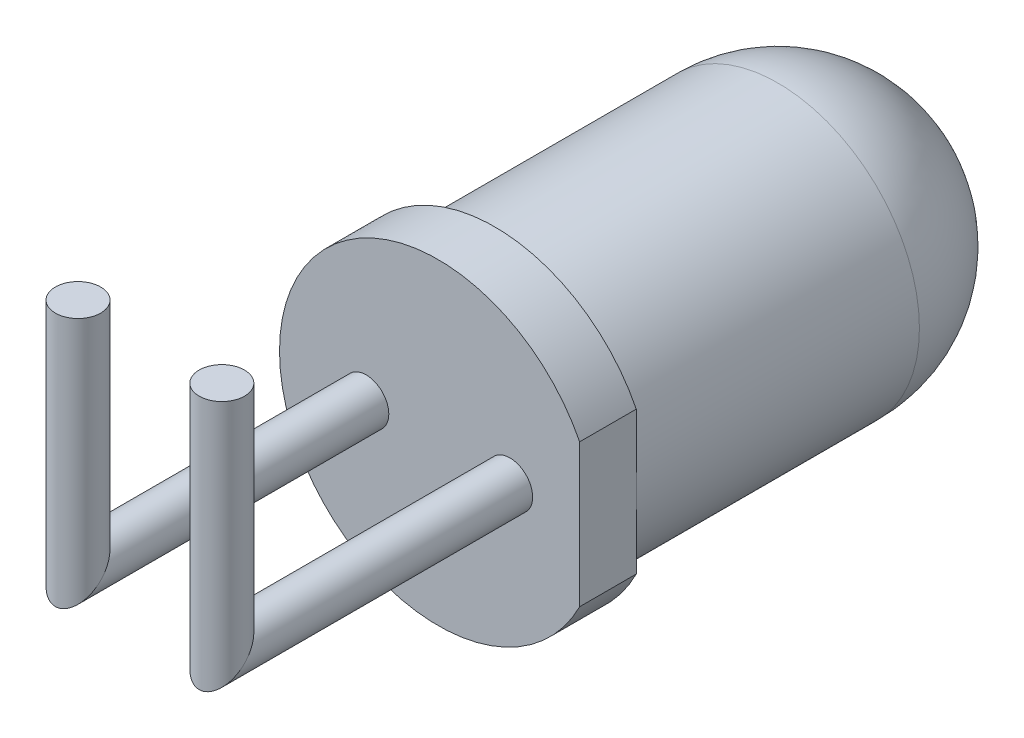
ISO-10303-21;
HEADER;
FILE_DESCRIPTION(('STEP AP214'),'2;1');
FILE_NAME('part.step','',(''),(''),'','','');
FILE_SCHEMA(('AUTOMOTIVE_DESIGN { 1 0 10303 214 1 1 1 1 }'));
ENDSEC;
DATA;
#1=APPLICATION_CONTEXT('core data for automotive mechanical design processes');
#2=APPLICATION_PROTOCOL_DEFINITION('international standard','automotive_design',2000,#1);
#3=PRODUCT_CONTEXT('',#1,'mechanical');
#4=PRODUCT('Part','Part','',(#3));
#5=PRODUCT_RELATED_PRODUCT_CATEGORY('part','',(#4));
#6=PRODUCT_DEFINITION_FORMATION('','',#4);
#7=PRODUCT_DEFINITION_CONTEXT('part definition',#1,'design');
#8=PRODUCT_DEFINITION('design','',#6,#7);
#9=PRODUCT_DEFINITION_SHAPE('','',#8);
#10=(LENGTH_UNIT() NAMED_UNIT(*) SI_UNIT(.MILLI.,.METRE.));
#11=(NAMED_UNIT(*) PLANE_ANGLE_UNIT() SI_UNIT($,.RADIAN.));
#12=(NAMED_UNIT(*) SI_UNIT($,.STERADIAN.) SOLID_ANGLE_UNIT());
#13=UNCERTAINTY_MEASURE_WITH_UNIT(LENGTH_MEASURE(1.E-05),#10,'distance_accuracy_value','');
#14=(GEOMETRIC_REPRESENTATION_CONTEXT(3) GLOBAL_UNCERTAINTY_ASSIGNED_CONTEXT((#13)) GLOBAL_UNIT_ASSIGNED_CONTEXT((#10,
#11,#12)) REPRESENTATION_CONTEXT('',''));
#15=CARTESIAN_POINT('',(0.,0.,0.));
#16=DIRECTION('',(0.,0.,1.));
#17=DIRECTION('',(1.,0.,0.));
#18=AXIS2_PLACEMENT_3D('',#15,#16,#17);
#19=CARTESIAN_POINT('',(0.,0.,8.5));
#20=DIRECTION('',(0.,0.,-1.));
#21=DIRECTION('',(-1.,0.,0.));
#22=AXIS2_PLACEMENT_3D('',#19,#20,#21);
#23=CYLINDRICAL_SURFACE('',#22,2.5);
#24=CARTESIAN_POINT('',(0.,0.,2.5));
#25=DIRECTION('',(0.,0.,-1.));
#26=DIRECTION('',(-1.,0.,0.));
#27=AXIS2_PLACEMENT_3D('',#24,#25,#26);
#28=CIRCLE('',#27,2.5);
#29=CARTESIAN_POINT('',(-2.5,0.,2.5));
#30=VERTEX_POINT('',#29);
#31=EDGE_CURVE('E31',#30,#30,#28,.F.);
#32=ORIENTED_EDGE('',*,*,#31,.T.);
#33=EDGE_LOOP('',(#32));
#34=FACE_BOUND('',#33,.T.);
#35=CARTESIAN_POINT('',(0.,0.,7.5));
#36=DIRECTION('',(0.,0.,1.));
#37=DIRECTION('',(1.,0.,0.));
#38=AXIS2_PLACEMENT_3D('',#35,#36,#37);
#39=CIRCLE('',#38,2.5);
#40=CARTESIAN_POINT('',(2.5,0.,7.5));
#41=VERTEX_POINT('',#40);
#42=EDGE_CURVE('E42',#41,#41,#39,.T.);
#43=ORIENTED_EDGE('',*,*,#42,.F.);
#44=EDGE_LOOP('',(#43));
#45=FACE_BOUND('',#44,.T.);
#46=ADVANCED_FACE('F28',(#34,#45),#23,.T.);
#47=CARTESIAN_POINT('',(0.,0.,7.5));
#48=DIRECTION('',(0.,0.,1.));
#49=DIRECTION('',(1.,0.,0.));
#50=AXIS2_PLACEMENT_3D('',#47,#48,#49);
#51=PLANE('',#50);
#52=DIRECTION('',(0.,1.,0.));
#53=VECTOR('',#52,1.);
#54=CARTESIAN_POINT('',(2.5,1.26095202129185,7.5));
#55=LINE('',#54,#53);
#56=CARTESIAN_POINT('',(2.5,1.26095202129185,7.5));
#57=VERTEX_POINT('',#56);
#58=EDGE_CURVE('E49',#41,#57,#55,.T.);
#59=ORIENTED_EDGE('',*,*,#58,.F.);
#60=ORIENTED_EDGE('',*,*,#42,.T.);
#61=CARTESIAN_POINT('',(2.5,-1.26095202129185,7.5));
#62=VERTEX_POINT('',#61);
#63=EDGE_CURVE('E71',#62,#41,#55,.T.);
#64=ORIENTED_EDGE('',*,*,#63,.F.);
#65=CARTESIAN_POINT('',(0.,0.,7.5));
#66=DIRECTION('',(0.,0.,1.));
#67=DIRECTION('',(1.,0.,0.));
#68=AXIS2_PLACEMENT_3D('',#65,#66,#67);
#69=CIRCLE('',#68,2.8);
#70=EDGE_CURVE('E67',#57,#62,#69,.T.);
#71=ORIENTED_EDGE('',*,*,#70,.F.);
#72=EDGE_LOOP('',(#59,#60,#64,#71));
#73=FACE_BOUND('',#72,.T.);
#74=ADVANCED_FACE('F117',(#73),#51,.F.);
#75=CARTESIAN_POINT('',(2.5,1.26095202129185,7.5));
#76=DIRECTION('',(1.,0.,0.));
#77=DIRECTION('',(0.,0.,-1.));
#78=AXIS2_PLACEMENT_3D('',#75,#76,#77);
#79=PLANE('',#78);
#80=ORIENTED_EDGE('',*,*,#63,.T.);
#81=ORIENTED_EDGE('',*,*,#58,.T.);
#82=DIRECTION('',(0.,0.,1.));
#83=VECTOR('',#82,1.);
#84=CARTESIAN_POINT('',(2.5,1.26095202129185,7.5));
#85=LINE('',#84,#83);
#86=CARTESIAN_POINT('',(2.5,1.26095202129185,8.5));
#87=VERTEX_POINT('',#86);
#88=EDGE_CURVE('E70',#57,#87,#85,.T.);
#89=ORIENTED_EDGE('',*,*,#88,.T.);
#90=DIRECTION('',(0.,1.,0.));
#91=VECTOR('',#90,1.);
#92=CARTESIAN_POINT('',(2.5,1.26095202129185,8.5));
#93=LINE('',#92,#91);
#94=CARTESIAN_POINT('',(2.5,-1.26095202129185,8.5));
#95=VERTEX_POINT('',#94);
#96=EDGE_CURVE('E75',#95,#87,#93,.T.);
#97=ORIENTED_EDGE('',*,*,#96,.F.);
#98=DIRECTION('',(0.,0.,1.));
#99=VECTOR('',#98,1.);
#100=CARTESIAN_POINT('',(2.5,-1.26095202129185,7.5));
#101=LINE('',#100,#99);
#102=EDGE_CURVE('E62',#62,#95,#101,.T.);
#103=ORIENTED_EDGE('',*,*,#102,.F.);
#104=EDGE_LOOP('',(#80,#81,#89,#97,#103));
#105=FACE_BOUND('',#104,.T.);
#106=ADVANCED_FACE('F78',(#105),#79,.T.);
#107=CARTESIAN_POINT('',(0.,0.,7.5));
#108=DIRECTION('',(0.,0.,1.));
#109=DIRECTION('',(1.,0.,0.));
#110=AXIS2_PLACEMENT_3D('',#107,#108,#109);
#111=CYLINDRICAL_SURFACE('',#110,2.8);
#112=CARTESIAN_POINT('',(0.,0.,8.5));
#113=DIRECTION('',(0.,0.,1.));
#114=DIRECTION('',(1.,0.,0.));
#115=AXIS2_PLACEMENT_3D('',#112,#113,#114);
#116=CIRCLE('',#115,2.8);
#117=EDGE_CURVE('E65',#87,#95,#116,.T.);
#118=ORIENTED_EDGE('',*,*,#117,.F.);
#119=ORIENTED_EDGE('',*,*,#88,.F.);
#120=ORIENTED_EDGE('',*,*,#70,.T.);
#121=ORIENTED_EDGE('',*,*,#102,.T.);
#122=EDGE_LOOP('',(#118,#119,#120,#121));
#123=FACE_BOUND('',#122,.T.);
#124=ADVANCED_FACE('F64',(#123),#111,.T.);
#125=CARTESIAN_POINT('',(0.,0.,8.5));
#126=DIRECTION('',(0.,0.,1.));
#127=DIRECTION('',(1.,0.,0.));
#128=AXIS2_PLACEMENT_3D('',#125,#126,#127);
#129=PLANE('',#128);
#130=CARTESIAN_POINT('',(1.27,0.,8.5));
#131=DIRECTION('',(0.,0.,1.));
#132=DIRECTION('',(1.,0.,0.));
#133=AXIS2_PLACEMENT_3D('',#130,#131,#132);
#134=CIRCLE('',#133,0.4);
#135=CARTESIAN_POINT('',(1.67,0.,8.5));
#136=VERTEX_POINT('',#135);
#137=EDGE_CURVE('E12',#136,#136,#134,.T.);
#138=ORIENTED_EDGE('',*,*,#137,.F.);
#139=EDGE_LOOP('',(#138));
#140=FACE_BOUND('',#139,.T.);
#141=CARTESIAN_POINT('',(-1.27,0.,8.5));
#142=DIRECTION('',(0.,0.,1.));
#143=DIRECTION('',(1.,0.,0.));
#144=AXIS2_PLACEMENT_3D('',#141,#142,#143);
#145=CIRCLE('',#144,0.4);
#146=CARTESIAN_POINT('',(-0.87,0.,8.5));
#147=VERTEX_POINT('',#146);
#148=EDGE_CURVE('E36',#147,#147,#145,.T.);
#149=ORIENTED_EDGE('',*,*,#148,.F.);
#150=EDGE_LOOP('',(#149));
#151=FACE_BOUND('',#150,.T.);
#152=ORIENTED_EDGE('',*,*,#96,.T.);
#153=ORIENTED_EDGE('',*,*,#117,.T.);
#154=EDGE_LOOP('',(#152,#153));
#155=FACE_BOUND('',#154,.T.);
#156=ADVANCED_FACE('F74',(#140,#151,#155),#129,.T.);
#157=CARTESIAN_POINT('',(0.,0.,2.5));
#158=DIRECTION('',(0.,0.,1.));
#159=DIRECTION('',(1.,0.,0.));
#160=AXIS2_PLACEMENT_3D('',#157,#158,#159);
#161=SPHERICAL_SURFACE('',#160,2.5);
#162=ORIENTED_EDGE('',*,*,#31,.F.);
#163=EDGE_LOOP('',(#162));
#164=FACE_BOUND('',#163,.T.);
#165=ADVANCED_FACE('F129',(#164),#161,.T.);
#166=CARTESIAN_POINT('',(-1.27,0.,13.5883629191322));
#167=DIRECTION('',(0.,1.,0.));
#168=DIRECTION('',(0.,0.,1.));
#169=AXIS2_PLACEMENT_3D('',#166,#167,#168);
#170=CYLINDRICAL_SURFACE('',#169,0.4);
#171=CARTESIAN_POINT('',(-1.27,0.,13.5883629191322));
#172=DIRECTION('',(0.,0.707106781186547,0.707106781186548));
#173=DIRECTION('',(0.,0.707106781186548,-0.707106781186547));
#174=AXIS2_PLACEMENT_3D('',#171,#172,#173);
#175=ELLIPSE('',#174,0.565685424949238,0.4);
#176=CARTESIAN_POINT('',(-1.27,0.4,13.1883629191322));
#177=VERTEX_POINT('',#176);
#178=EDGE_CURVE('E96',#177,#177,#175,.T.);
#179=ORIENTED_EDGE('',*,*,#178,.T.);
#180=EDGE_LOOP('',(#179));
#181=FACE_BOUND('',#180,.T.);
#182=CARTESIAN_POINT('',(-1.27,4.08836291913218,13.5883629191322));
#183=DIRECTION('',(0.,1.,0.));
#184=DIRECTION('',(0.,0.,1.));
#185=AXIS2_PLACEMENT_3D('',#182,#183,#184);
#186=CIRCLE('',#185,0.4);
#187=CARTESIAN_POINT('',(-1.27,4.08836291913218,13.9883629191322));
#188=VERTEX_POINT('',#187);
#189=EDGE_CURVE('E76',#188,#188,#186,.F.);
#190=ORIENTED_EDGE('',*,*,#189,.T.);
#191=EDGE_LOOP('',(#190));
#192=FACE_BOUND('',#191,.T.);
#193=ADVANCED_FACE('F101',(#181,#192),#170,.T.);
#194=CARTESIAN_POINT('',(-1.27,0.,14.7197337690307));
#195=DIRECTION('',(0.,0.,-1.));
#196=DIRECTION('',(0.,1.,0.));
#197=AXIS2_PLACEMENT_3D('',#194,#195,#196);
#198=CYLINDRICAL_SURFACE('',#197,0.4);
#199=ORIENTED_EDGE('',*,*,#148,.T.);
#200=EDGE_LOOP('',(#199));
#201=FACE_BOUND('',#200,.T.);
#202=ORIENTED_EDGE('',*,*,#178,.F.);
#203=EDGE_LOOP('',(#202));
#204=FACE_BOUND('',#203,.T.);
#205=ADVANCED_FACE('F106',(#201,#204),#198,.T.);
#206=CARTESIAN_POINT('',(-1.27,4.08836291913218,13.5883629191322));
#207=DIRECTION('',(0.,1.,0.));
#208=DIRECTION('',(0.,0.,1.));
#209=AXIS2_PLACEMENT_3D('',#206,#207,#208);
#210=PLANE('',#209);
#211=ORIENTED_EDGE('',*,*,#189,.F.);
#212=EDGE_LOOP('',(#211));
#213=FACE_BOUND('',#212,.T.);
#214=ADVANCED_FACE('F103',(#213),#210,.T.);
#215=CARTESIAN_POINT('',(1.27,0.,13.5883629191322));
#216=DIRECTION('',(0.,1.,0.));
#217=DIRECTION('',(0.,0.,1.));
#218=AXIS2_PLACEMENT_3D('',#215,#216,#217);
#219=CYLINDRICAL_SURFACE('',#218,0.4);
#220=CARTESIAN_POINT('',(1.27,0.,13.5883629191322));
#221=DIRECTION('',(0.,0.707106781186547,0.707106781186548));
#222=DIRECTION('',(0.,0.707106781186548,-0.707106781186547));
#223=AXIS2_PLACEMENT_3D('',#220,#221,#222);
#224=ELLIPSE('',#223,0.565685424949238,0.4);
#225=CARTESIAN_POINT('',(1.27,0.4,13.1883629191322));
#226=VERTEX_POINT('',#225);
#227=EDGE_CURVE('E147',#226,#226,#224,.T.);
#228=ORIENTED_EDGE('',*,*,#227,.T.);
#229=EDGE_LOOP('',(#228));
#230=FACE_BOUND('',#229,.T.);
#231=CARTESIAN_POINT('',(1.27,4.08836291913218,13.5883629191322));
#232=DIRECTION('',(0.,1.,0.));
#233=DIRECTION('',(0.,0.,1.));
#234=AXIS2_PLACEMENT_3D('',#231,#232,#233);
#235=CIRCLE('',#234,0.4);
#236=CARTESIAN_POINT('',(1.27,4.08836291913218,13.9883629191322));
#237=VERTEX_POINT('',#236);
#238=EDGE_CURVE('E94',#237,#237,#235,.F.);
#239=ORIENTED_EDGE('',*,*,#238,.T.);
#240=EDGE_LOOP('',(#239));
#241=FACE_BOUND('',#240,.T.);
#242=ADVANCED_FACE('F105',(#230,#241),#219,.T.);
#243=CARTESIAN_POINT('',(1.27,0.,14.7197337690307));
#244=DIRECTION('',(0.,0.,-1.));
#245=DIRECTION('',(0.,1.,0.));
#246=AXIS2_PLACEMENT_3D('',#243,#244,#245);
#247=CYLINDRICAL_SURFACE('',#246,0.4);
#248=ORIENTED_EDGE('',*,*,#137,.T.);
#249=EDGE_LOOP('',(#248));
#250=FACE_BOUND('',#249,.T.);
#251=ORIENTED_EDGE('',*,*,#227,.F.);
#252=EDGE_LOOP('',(#251));
#253=FACE_BOUND('',#252,.T.);
#254=ADVANCED_FACE('F112',(#250,#253),#247,.T.);
#255=CARTESIAN_POINT('',(1.27,4.08836291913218,13.5883629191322));
#256=DIRECTION('',(0.,1.,0.));
#257=DIRECTION('',(0.,0.,1.));
#258=AXIS2_PLACEMENT_3D('',#255,#256,#257);
#259=PLANE('',#258);
#260=ORIENTED_EDGE('',*,*,#238,.F.);
#261=EDGE_LOOP('',(#260));
#262=FACE_BOUND('',#261,.T.);
#263=ADVANCED_FACE('F143',(#262),#259,.T.);
#264=CLOSED_SHELL('',(#46,#74,#106,#124,#156,#165,#193,#205,#214,#242,#254,#263));
#265=MANIFOLD_SOLID_BREP('B2',#264);
#266=ADVANCED_BREP_SHAPE_REPRESENTATION('',(#18,#265),#14);
#267=SHAPE_DEFINITION_REPRESENTATION(#9,#266);
ENDSEC;
END-ISO-10303-21;
